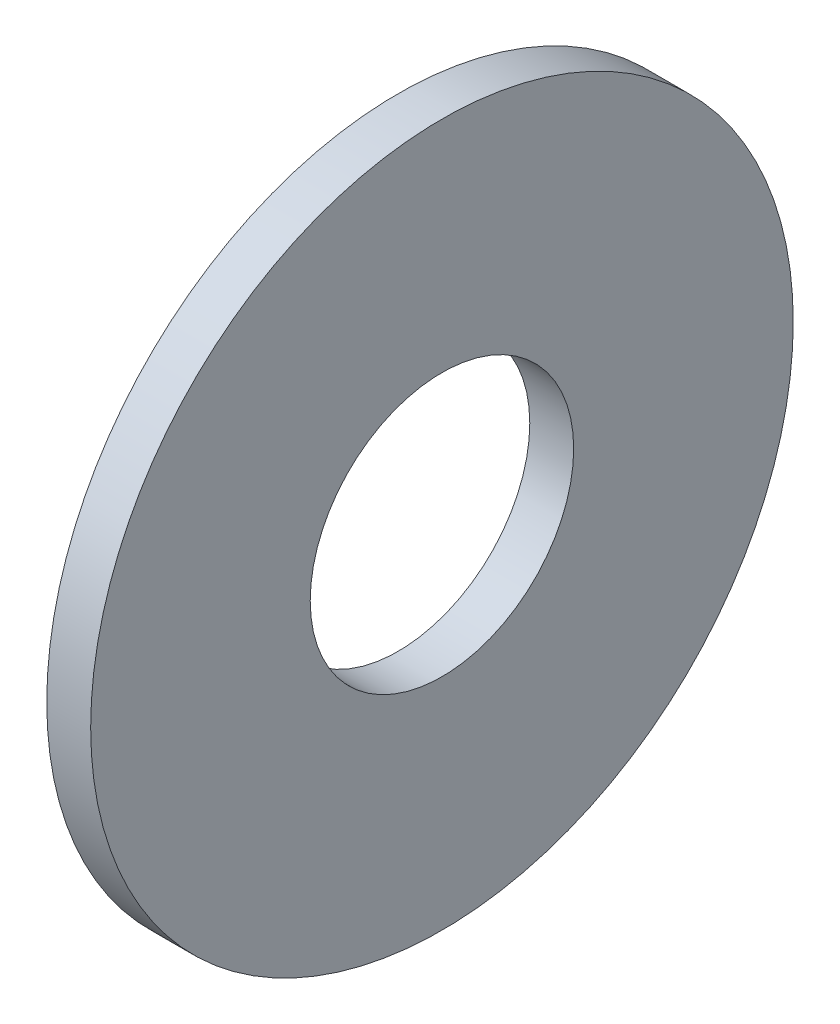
from build123d import *

# Parameters (mm, degrees)
SKETCH1_R          = 4
SKETCH1_R_2        = 1.5
BASE_EXTRUDE_DEPTH = 0.5


with BuildPart() as part:
    # Sketch1 → Base-Extrude (new body)
    with BuildSketch(Plane(origin=(0, 0, 0), x_dir=(0, 0, -1), z_dir=(1, 0, 0))):
        Circle(SKETCH1_R)
        Circle(SKETCH1_R_2, mode=Mode.SUBTRACT)
    extrude(amount=BASE_EXTRUDE_DEPTH)


solid = part.part
